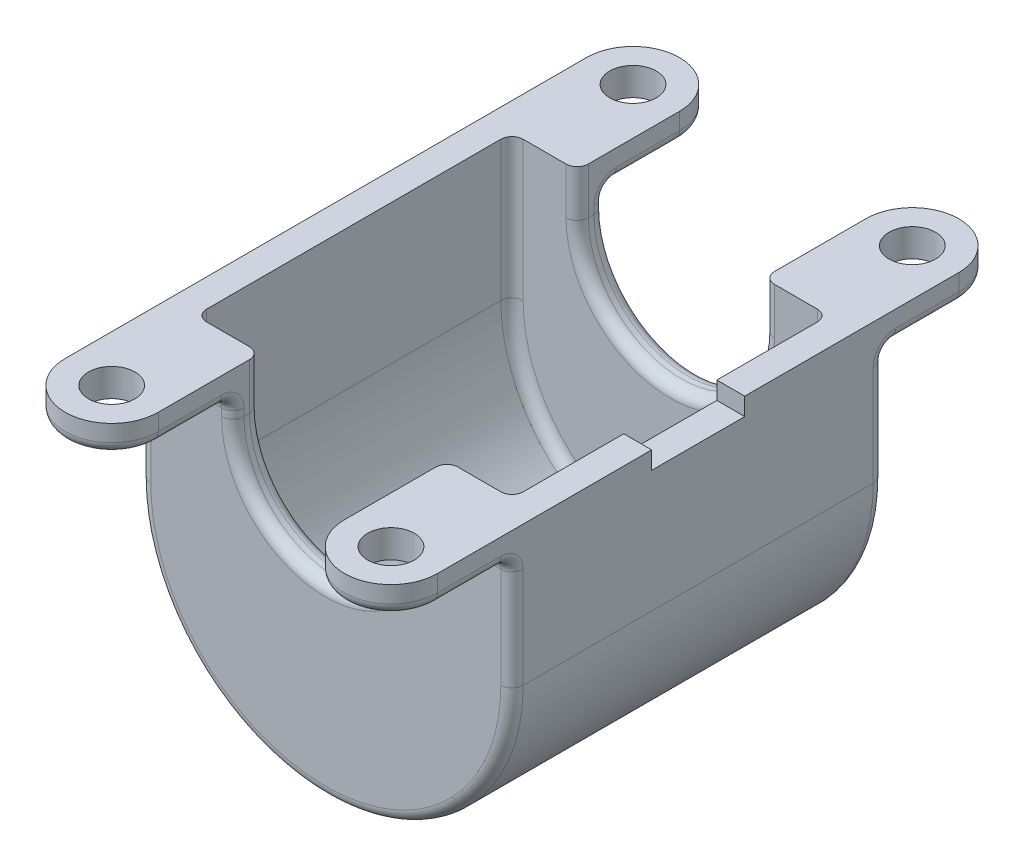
from build123d import *

# Parameters (mm, degrees)
EXTRUDE1_DEPTH             = 50.8
SHELL1_T                   = -7.62
EXTRUDE2_DEPTH             = 7.62
F_1_2_0_5_DIAMETER_HOLE1_D = 12.7
MIRROR2_COPY_1_DEPTH       = 7.62
MIRROR2_COPY_2_D           = 12.7
CUT_EXTRUDE1_REACH         = 154.167
SKETCH5_W                  = 25.4
SKETCH5_H                  = 4.826
FILLET1_R                  = 3.048
FILLET2_R                  = 3.048


with BuildPart() as part:
    # Sketch1 → Extrude1 (new, symmetric)
    with BuildSketch(Plane.XY):
        with BuildLine():
            Line((25.4, 12.7), (25.4, 0))
            ThreePointArc((25.4, 0), (0, -25.4), (-25.4, 0))
            Line((-25.4, 0), (-25.4, 12.7))
            Line((-25.4, 12.7), (-50.8, 12.7))
            Line((-50.8, 12.7), (-50.8, -25.4))
            ThreePointArc((-50.8, -25.4), (0, -76.2), (50.8, -25.4))
            Line((50.8, -25.4), (50.8, 12.7))
            Line((50.8, 12.7), (25.4, 12.7))
        make_face()
    extrude(amount=EXTRUDE1_DEPTH, both=True)

    # Shell1
    shell1_openings = [part.faces().sort_by_distance(p)[0] for p in [
        (-38.1, 12.7, 0),
        (-25.4, 6.35, 0),
        (0, -25.4, 0),
        (25.4, 6.35, 0),
        (38.1, 12.7, 0),
    ]]
    offset(amount=SHELL1_T, openings=shell1_openings, kind=Kind.INTERSECTION)

    # Sketch2 → Extrude2 (add)
    with BuildSketch(Plane(origin=(0, 12.7, 0), x_dir=(-1, 0, 0), z_dir=(0, 1, 0))):
        with BuildLine():
            Line((50.8, 50.8), (25.4, 50.8))
            Line((25.4, 50.8), (25.4, 71.12))
            ThreePointArc((25.4, 71.12), (38.1, 83.82), (50.8, 71.12))
            Line((50.8, 71.12), (50.8, 50.8))
        make_face()
    extrude2 = extrude(amount=-EXTRUDE2_DEPTH)

    # 1_2 _0.5_ Diameter Hole1 (through all)
    with Locations(Plane(origin=(0, 12.7, 0), x_dir=(-1, 0, 0), z_dir=(0, 1, 0))):
        with Locations((38.1, 71.12)):
            f_1_2_0_5_diameter_hole1 = Hole(F_1_2_0_5_DIAMETER_HOLE1_D / 2)

    # Mirror1: Extrude2, 1_2 _0.5_ Diameter Hole1 across plane
    add(extrude2.mirror(Plane(origin=(0, 0, 0), x_dir=(0, 0, 1), z_dir=(1, 0, 0))))
    add(f_1_2_0_5_diameter_hole1.mirror(Plane(origin=(0, 0, 0), x_dir=(0, 0, 1), z_dir=(1, 0, 0))), mode=Mode.SUBTRACT)

    # Mirror2: Extrude2, 1_2 _0.5_ Diameter Hole1 across plane
    add(extrude2.mirror(Plane.XY))
    add(f_1_2_0_5_diameter_hole1.mirror(Plane.XY), mode=Mode.SUBTRACT)

    # Mirror2 copy 1 sketch → Mirror2 copy 1 (add)
    with BuildSketch(Plane(origin=(0, 12.7, 0), x_dir=(1, 0, 0), z_dir=(0, 1, 0))):
        with BuildLine():
            Line((50.8, 50.8), (25.4, 50.8))
            Line((25.4, 50.8), (25.4, 71.12))
            ThreePointArc((25.4, 71.12), (38.1, 83.82), (50.8, 71.12))
            Line((50.8, 71.12), (50.8, 50.8))
        make_face()
    extrude(amount=-MIRROR2_COPY_1_DEPTH)

    # Mirror2 copy 2 (through all)
    with Locations(Plane(origin=(0, 12.7, 0), x_dir=(1, 0, 0), z_dir=(0, 1, 0))):
        with Locations((38.1, 71.12)):
            Hole(MIRROR2_COPY_2_D / 2)

    # Sketch5 → Cut-Extrude1 (cut, up to next)
    with BuildSketch(Plane(origin=(50.8, 0, 0), x_dir=(0, 0, -1), z_dir=(1, 0, 0)), mode=Mode.PRIVATE) as cut_extrude1_sk1:
        with Locations((0, 10.287)):
            Rectangle(SKETCH5_W, SKETCH5_H)
    cut_extrude1_tool1 = extrude(cut_extrude1_sk1.sketch, amount=-CUT_EXTRUDE1_REACH, mode=Mode.PRIVATE) & part.part
    add(cut_extrude1_tool1.solids().sort_by_distance((50.8, 10.287, 0))[0], mode=Mode.SUBTRACT)

    # Fillet1
    fillet1_edges = [part.edges().sort_by_distance(p)[0] for p in [
        (25.4, 6.35, 43.18),
        (-25.4, 6.35, 43.18),
        (-43.18, -6.35, 43.18),
        (43.18, -6.35, 43.18),
        (25.4, 6.35, -43.18),
        (-25.4, 6.35, -43.18),
        (-43.18, -6.35, -43.18),
        (43.18, -6.35, -43.18),
        (-38.1, 5.08, -50.8),
        (38.1, 5.08, -50.8),
        (38.1, 5.08, 50.8),
        (-38.1, 5.08, 50.8),
        (0, -25.4, 43.18),
        (0, -68.58, 43.18),
        (0, -25.4, -43.18),
        (0, -68.58, -43.18),
    ]]
    fillet(fillet1_edges, radius=FILLET1_R)

    # Fillet2
    fillet2_edges = [part.edges().sort_by_distance(p)[0] for p in [
        (0, -25.4, 50.8),
        (-38.1, 5.08, -83.82),
        (-25.4, 5.08, -62.484),
        (-25.4, 1.016, 50.8),
        (25.4, 1.016, 50.8),
        (25.4, 1.016, -50.8),
        (-50.8, 5.08, -62.484),
        (-50.8, -11.684, -50.8),
        (50.8, 5.08, -62.484),
        (50.8, 5.08, 62.484),
        (-50.8, -11.684, 50.8),
        (-50.8, 5.08, 62.484),
        (-50.8, 4.187261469, -51.692738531),
        (-25.4, 4.187261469, -51.692738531),
        (50.8, 4.187261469, -51.692738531),
        (25.4, 4.187261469, -51.692738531),
        (50.8, 4.187261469, 51.692738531),
        (25.4, 4.187261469, 51.692738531),
        (-50.8, 4.187261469, 51.692738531),
        (-25.4, 4.187261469, 51.692738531),
        (0, -76.2, 50.8),
        (50.8, -11.684, 50.8),
        (-25.4, 5.08, 62.484),
        (-38.1, 5.08, 83.82),
        (38.1, 5.08, 83.82),
        (25.4, 5.08, 62.484),
        (50.8, -11.684, -50.8),
        (0, -76.2, -50.8),
        (25.4, 5.08, -62.484),
        (38.1, 5.08, -83.82),
        (-25.4, 1.016, -50.8),
        (0, -25.4, -50.8),
    ]]
    fillet(fillet2_edges, radius=FILLET2_R)


solid = part.part
